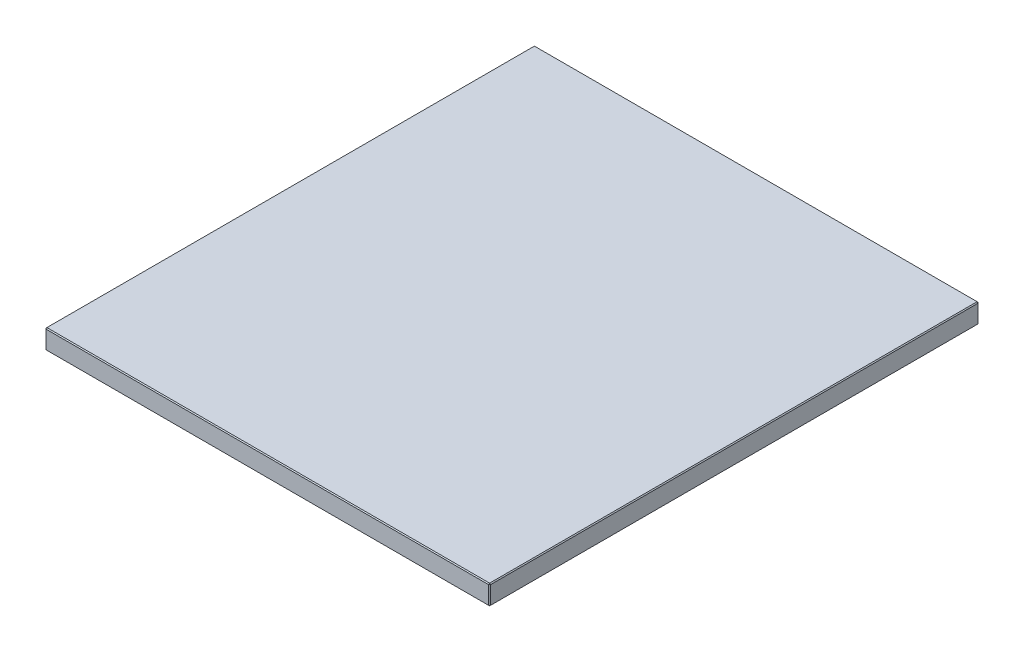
ISO-10303-21;
HEADER;
FILE_DESCRIPTION(('STEP AP214'),'2;1');
FILE_NAME('part.step','',(''),(''),'','','');
FILE_SCHEMA(('AUTOMOTIVE_DESIGN { 1 0 10303 214 1 1 1 1 }'));
ENDSEC;
DATA;
#1=APPLICATION_CONTEXT('core data for automotive mechanical design processes');
#2=APPLICATION_PROTOCOL_DEFINITION('international standard','automotive_design',2000,#1);
#3=PRODUCT_CONTEXT('',#1,'mechanical');
#4=PRODUCT('Part','Part','',(#3));
#5=PRODUCT_RELATED_PRODUCT_CATEGORY('part','',(#4));
#6=PRODUCT_DEFINITION_FORMATION('','',#4);
#7=PRODUCT_DEFINITION_CONTEXT('part definition',#1,'design');
#8=PRODUCT_DEFINITION('design','',#6,#7);
#9=PRODUCT_DEFINITION_SHAPE('','',#8);
#10=(LENGTH_UNIT() NAMED_UNIT(*) SI_UNIT(.MILLI.,.METRE.));
#11=(NAMED_UNIT(*) PLANE_ANGLE_UNIT() SI_UNIT($,.RADIAN.));
#12=(NAMED_UNIT(*) SI_UNIT($,.STERADIAN.) SOLID_ANGLE_UNIT());
#13=UNCERTAINTY_MEASURE_WITH_UNIT(LENGTH_MEASURE(1.E-05),#10,'distance_accuracy_value','');
#14=(GEOMETRIC_REPRESENTATION_CONTEXT(3) GLOBAL_UNCERTAINTY_ASSIGNED_CONTEXT((#13)) GLOBAL_UNIT_ASSIGNED_CONTEXT((#10,
#11,#12)) REPRESENTATION_CONTEXT('',''));
#15=CARTESIAN_POINT('',(0.,0.,0.));
#16=DIRECTION('',(0.,0.,1.));
#17=DIRECTION('',(1.,0.,0.));
#18=AXIS2_PLACEMENT_3D('',#15,#16,#17);
#19=CARTESIAN_POINT('',(-248.,22.,273.));
#20=DIRECTION('',(1.,0.,0.));
#21=DIRECTION('',(0.,0.,-1.));
#22=AXIS2_PLACEMENT_3D('',#19,#20,#21);
#23=PLANE('',#22);
#24=DIRECTION('',(0.,-1.,0.));
#25=VECTOR('',#24,1.);
#26=CARTESIAN_POINT('',(-248.,22.,-272.));
#27=LINE('',#26,#25);
#28=CARTESIAN_POINT('',(-248.,21.,-272.));
#29=VERTEX_POINT('',#28);
#30=CARTESIAN_POINT('',(-248.,1.00000000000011,-272.));
#31=VERTEX_POINT('',#30);
#32=EDGE_CURVE('E114',#29,#31,#27,.T.);
#33=ORIENTED_EDGE('',*,*,#32,.T.);
#34=DIRECTION('',(0.,0.,1.));
#35=VECTOR('',#34,1.);
#36=CARTESIAN_POINT('',(-248.,1.00000000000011,273.));
#37=LINE('',#36,#35);
#38=CARTESIAN_POINT('',(-248.,1.00000000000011,272.));
#39=VERTEX_POINT('',#38);
#40=EDGE_CURVE('E110',#31,#39,#37,.T.);
#41=ORIENTED_EDGE('',*,*,#40,.T.);
#42=DIRECTION('',(0.,1.,0.));
#43=VECTOR('',#42,1.);
#44=CARTESIAN_POINT('',(-248.,22.,272.));
#45=LINE('',#44,#43);
#46=CARTESIAN_POINT('',(-248.,21.,272.));
#47=VERTEX_POINT('',#46);
#48=EDGE_CURVE('E103',#39,#47,#45,.T.);
#49=ORIENTED_EDGE('',*,*,#48,.T.);
#50=DIRECTION('',(0.,0.,-1.));
#51=VECTOR('',#50,1.);
#52=CARTESIAN_POINT('',(-248.,21.,-273.));
#53=LINE('',#52,#51);
#54=EDGE_CURVE('E107',#47,#29,#53,.T.);
#55=ORIENTED_EDGE('',*,*,#54,.T.);
#56=EDGE_LOOP('',(#33,#41,#49,#55));
#57=FACE_BOUND('',#56,.T.);
#58=ADVANCED_FACE('F15',(#57),#23,.F.);
#59=CARTESIAN_POINT('',(248.,22.,273.));
#60=DIRECTION('',(0.,0.,-1.));
#61=DIRECTION('',(-1.,0.,0.));
#62=AXIS2_PLACEMENT_3D('',#59,#60,#61);
#63=PLANE('',#62);
#64=DIRECTION('',(-1.,0.,0.));
#65=VECTOR('',#64,1.);
#66=CARTESIAN_POINT('',(-248.,21.,273.));
#67=LINE('',#66,#65);
#68=CARTESIAN_POINT('',(247.,21.,273.));
#69=VERTEX_POINT('',#68);
#70=CARTESIAN_POINT('',(-247.,21.,273.));
#71=VERTEX_POINT('',#70);
#72=EDGE_CURVE('E164',#69,#71,#67,.T.);
#73=ORIENTED_EDGE('',*,*,#72,.T.);
#74=DIRECTION('',(0.,-1.,0.));
#75=VECTOR('',#74,1.);
#76=CARTESIAN_POINT('',(-247.,22.,273.));
#77=LINE('',#76,#75);
#78=CARTESIAN_POINT('',(-247.,1.00000000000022,273.));
#79=VERTEX_POINT('',#78);
#80=EDGE_CURVE('E122',#71,#79,#77,.T.);
#81=ORIENTED_EDGE('',*,*,#80,.T.);
#82=DIRECTION('',(1.,0.,0.));
#83=VECTOR('',#82,1.);
#84=CARTESIAN_POINT('',(248.,1.00000000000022,273.));
#85=LINE('',#84,#83);
#86=CARTESIAN_POINT('',(247.,1.00000000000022,273.));
#87=VERTEX_POINT('',#86);
#88=EDGE_CURVE('E168',#79,#87,#85,.T.);
#89=ORIENTED_EDGE('',*,*,#88,.T.);
#90=DIRECTION('',(0.,1.,0.));
#91=VECTOR('',#90,1.);
#92=CARTESIAN_POINT('',(247.,22.,273.));
#93=LINE('',#92,#91);
#94=EDGE_CURVE('E166',#87,#69,#93,.T.);
#95=ORIENTED_EDGE('',*,*,#94,.T.);
#96=EDGE_LOOP('',(#73,#81,#89,#95));
#97=FACE_BOUND('',#96,.T.);
#98=ADVANCED_FACE('F275',(#97),#63,.F.);
#99=CARTESIAN_POINT('',(248.,22.,273.));
#100=DIRECTION('',(-1.,0.,0.));
#101=DIRECTION('',(0.,0.,1.));
#102=AXIS2_PLACEMENT_3D('',#99,#100,#101);
#103=PLANE('',#102);
#104=DIRECTION('',(0.,0.,-1.));
#105=VECTOR('',#104,1.);
#106=CARTESIAN_POINT('',(248.,1.00000000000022,273.));
#107=LINE('',#106,#105);
#108=CARTESIAN_POINT('',(248.,1.00000000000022,272.));
#109=VERTEX_POINT('',#108);
#110=CARTESIAN_POINT('',(248.,1.00000000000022,-272.));
#111=VERTEX_POINT('',#110);
#112=EDGE_CURVE('E159',#109,#111,#107,.T.);
#113=ORIENTED_EDGE('',*,*,#112,.T.);
#114=DIRECTION('',(0.,1.,0.));
#115=VECTOR('',#114,1.);
#116=CARTESIAN_POINT('',(248.,22.,-272.));
#117=LINE('',#116,#115);
#118=CARTESIAN_POINT('',(248.,21.,-272.));
#119=VERTEX_POINT('',#118);
#120=EDGE_CURVE('E161',#111,#119,#117,.T.);
#121=ORIENTED_EDGE('',*,*,#120,.T.);
#122=DIRECTION('',(0.,0.,1.));
#123=VECTOR('',#122,1.);
#124=CARTESIAN_POINT('',(248.,21.,273.));
#125=LINE('',#124,#123);
#126=CARTESIAN_POINT('',(248.,21.,272.));
#127=VERTEX_POINT('',#126);
#128=EDGE_CURVE('E155',#119,#127,#125,.T.);
#129=ORIENTED_EDGE('',*,*,#128,.T.);
#130=DIRECTION('',(0.,-1.,0.));
#131=VECTOR('',#130,1.);
#132=CARTESIAN_POINT('',(248.,22.,272.));
#133=LINE('',#132,#131);
#134=EDGE_CURVE('E157',#127,#109,#133,.T.);
#135=ORIENTED_EDGE('',*,*,#134,.T.);
#136=EDGE_LOOP('',(#113,#121,#129,#135));
#137=FACE_BOUND('',#136,.T.);
#138=ADVANCED_FACE('F254',(#137),#103,.F.);
#139=CARTESIAN_POINT('',(248.,22.,-273.));
#140=DIRECTION('',(0.,0.,1.));
#141=DIRECTION('',(1.,0.,0.));
#142=AXIS2_PLACEMENT_3D('',#139,#140,#141);
#143=PLANE('',#142);
#144=DIRECTION('',(0.,-1.,0.));
#145=VECTOR('',#144,1.);
#146=CARTESIAN_POINT('',(247.,22.,-273.));
#147=LINE('',#146,#145);
#148=CARTESIAN_POINT('',(247.,21.,-273.));
#149=VERTEX_POINT('',#148);
#150=CARTESIAN_POINT('',(247.,1.00000000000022,-273.));
#151=VERTEX_POINT('',#150);
#152=EDGE_CURVE('E148',#149,#151,#147,.T.);
#153=ORIENTED_EDGE('',*,*,#152,.T.);
#154=DIRECTION('',(-1.,0.,0.));
#155=VECTOR('',#154,1.);
#156=CARTESIAN_POINT('',(248.,1.00000000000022,-273.));
#157=LINE('',#156,#155);
#158=CARTESIAN_POINT('',(-247.,1.00000000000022,-273.));
#159=VERTEX_POINT('',#158);
#160=EDGE_CURVE('E153',#151,#159,#157,.T.);
#161=ORIENTED_EDGE('',*,*,#160,.T.);
#162=DIRECTION('',(0.,1.,0.));
#163=VECTOR('',#162,1.);
#164=CARTESIAN_POINT('',(-247.,22.,-273.));
#165=LINE('',#164,#163);
#166=CARTESIAN_POINT('',(-247.,21.,-273.));
#167=VERTEX_POINT('',#166);
#168=EDGE_CURVE('E150',#159,#167,#165,.T.);
#169=ORIENTED_EDGE('',*,*,#168,.T.);
#170=DIRECTION('',(1.,0.,0.));
#171=VECTOR('',#170,1.);
#172=CARTESIAN_POINT('',(248.,21.,-273.));
#173=LINE('',#172,#171);
#174=EDGE_CURVE('E146',#167,#149,#173,.T.);
#175=ORIENTED_EDGE('',*,*,#174,.T.);
#176=EDGE_LOOP('',(#153,#161,#169,#175));
#177=FACE_BOUND('',#176,.T.);
#178=ADVANCED_FACE('F284',(#177),#143,.F.);
#179=CARTESIAN_POINT('',(0.,22.,0.));
#180=DIRECTION('',(0.,1.,0.));
#181=DIRECTION('',(0.,0.,1.));
#182=AXIS2_PLACEMENT_3D('',#179,#180,#181);
#183=PLANE('',#182);
#184=DIRECTION('',(0.,0.,-1.));
#185=VECTOR('',#184,1.);
#186=CARTESIAN_POINT('',(247.,22.,-273.));
#187=LINE('',#186,#185);
#188=CARTESIAN_POINT('',(247.,22.,272.));
#189=VERTEX_POINT('',#188);
#190=CARTESIAN_POINT('',(247.,22.,-272.));
#191=VERTEX_POINT('',#190);
#192=EDGE_CURVE('E24',#189,#191,#187,.T.);
#193=ORIENTED_EDGE('',*,*,#192,.T.);
#194=DIRECTION('',(-1.,0.,0.));
#195=VECTOR('',#194,1.);
#196=CARTESIAN_POINT('',(-248.,22.,-272.));
#197=LINE('',#196,#195);
#198=CARTESIAN_POINT('',(-247.,22.,-272.));
#199=VERTEX_POINT('',#198);
#200=EDGE_CURVE('E9',#191,#199,#197,.T.);
#201=ORIENTED_EDGE('',*,*,#200,.T.);
#202=DIRECTION('',(0.,0.,1.));
#203=VECTOR('',#202,1.);
#204=CARTESIAN_POINT('',(-247.,22.,273.));
#205=LINE('',#204,#203);
#206=CARTESIAN_POINT('',(-247.,22.,272.));
#207=VERTEX_POINT('',#206);
#208=EDGE_CURVE('E180',#199,#207,#205,.T.);
#209=ORIENTED_EDGE('',*,*,#208,.T.);
#210=DIRECTION('',(1.,0.,0.));
#211=VECTOR('',#210,1.);
#212=CARTESIAN_POINT('',(248.,22.,272.));
#213=LINE('',#212,#211);
#214=EDGE_CURVE('E35',#207,#189,#213,.T.);
#215=ORIENTED_EDGE('',*,*,#214,.T.);
#216=EDGE_LOOP('',(#193,#201,#209,#215));
#217=FACE_BOUND('',#216,.T.);
#218=ADVANCED_FACE('F350',(#217),#183,.T.);
#219=CARTESIAN_POINT('',(0.,0.,0.));
#220=DIRECTION('',(0.,1.,0.));
#221=DIRECTION('',(0.,0.,1.));
#222=AXIS2_PLACEMENT_3D('',#219,#220,#221);
#223=PLANE('',#222);
#224=DIRECTION('',(0.,0.,1.));
#225=VECTOR('',#224,1.);
#226=CARTESIAN_POINT('',(247.,0.,0.));
#227=LINE('',#226,#225);
#228=CARTESIAN_POINT('',(247.,0.,-272.));
#229=VERTEX_POINT('',#228);
#230=CARTESIAN_POINT('',(247.,0.,272.));
#231=VERTEX_POINT('',#230);
#232=EDGE_CURVE('E171',#229,#231,#227,.T.);
#233=ORIENTED_EDGE('',*,*,#232,.T.);
#234=DIRECTION('',(-1.,0.,0.));
#235=VECTOR('',#234,1.);
#236=CARTESIAN_POINT('',(0.,0.,272.));
#237=LINE('',#236,#235);
#238=CARTESIAN_POINT('',(-247.,0.,272.));
#239=VERTEX_POINT('',#238);
#240=EDGE_CURVE('E177',#231,#239,#237,.T.);
#241=ORIENTED_EDGE('',*,*,#240,.T.);
#242=DIRECTION('',(0.,0.,-1.));
#243=VECTOR('',#242,1.);
#244=CARTESIAN_POINT('',(-247.,0.,0.));
#245=LINE('',#244,#243);
#246=CARTESIAN_POINT('',(-247.,0.,-272.));
#247=VERTEX_POINT('',#246);
#248=EDGE_CURVE('E175',#239,#247,#245,.T.);
#249=ORIENTED_EDGE('',*,*,#248,.T.);
#250=DIRECTION('',(1.,0.,0.));
#251=VECTOR('',#250,1.);
#252=CARTESIAN_POINT('',(0.,0.,-272.));
#253=LINE('',#252,#251);
#254=EDGE_CURVE('E173',#247,#229,#253,.T.);
#255=ORIENTED_EDGE('',*,*,#254,.T.);
#256=EDGE_LOOP('',(#233,#241,#249,#255));
#257=FACE_BOUND('',#256,.T.);
#258=ADVANCED_FACE('F246',(#257),#223,.F.);
#259=CARTESIAN_POINT('',(248.,22.,272.));
#260=DIRECTION('',(-0.707106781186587,0.,-0.707106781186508));
#261=DIRECTION('',(0.,-1.,0.));
#262=AXIS2_PLACEMENT_3D('',#259,#260,#261);
#263=PLANE('',#262);
#264=DIRECTION('',(-0.707106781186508,0.,0.707106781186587));
#265=VECTOR('',#264,1.);
#266=CARTESIAN_POINT('',(247.,21.,273.));
#267=LINE('',#266,#265);
#268=EDGE_CURVE('E19',#69,#127,#267,.F.);
#269=ORIENTED_EDGE('',*,*,#268,.F.);
#270=ORIENTED_EDGE('',*,*,#94,.F.);
#271=DIRECTION('',(0.707106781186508,0.,-0.707106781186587));
#272=VECTOR('',#271,1.);
#273=CARTESIAN_POINT('',(247.,1.00000000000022,273.));
#274=LINE('',#273,#272);
#275=EDGE_CURVE('E142',#109,#87,#274,.F.);
#276=ORIENTED_EDGE('',*,*,#275,.F.);
#277=ORIENTED_EDGE('',*,*,#134,.F.);
#278=EDGE_LOOP('',(#269,#270,#276,#277));
#279=FACE_BOUND('',#278,.T.);
#280=ADVANCED_FACE('F17',(#279),#263,.F.);
#281=CARTESIAN_POINT('',(247.,21.,273.));
#282=DIRECTION('',(0.577350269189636,0.577350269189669,0.577350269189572));
#283=DIRECTION('',(-0.707106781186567,0.707106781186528,0.));
#284=AXIS2_PLACEMENT_3D('',#281,#282,#283);
#285=PLANE('',#284);
#286=DIRECTION('',(0.,-0.707106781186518,0.707106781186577));
#287=VECTOR('',#286,1.);
#288=CARTESIAN_POINT('',(247.,21.,273.));
#289=LINE('',#288,#287);
#290=EDGE_CURVE('E226',#69,#189,#289,.F.);
#291=ORIENTED_EDGE('',*,*,#290,.F.);
#292=ORIENTED_EDGE('',*,*,#268,.T.);
#293=DIRECTION('',(-0.707106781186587,0.707106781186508,0.));
#294=VECTOR('',#293,1.);
#295=CARTESIAN_POINT('',(247.5,21.5,272.));
#296=LINE('',#295,#294);
#297=EDGE_CURVE('E228',#189,#127,#296,.F.);
#298=ORIENTED_EDGE('',*,*,#297,.F.);
#299=EDGE_LOOP('',(#291,#292,#298));
#300=FACE_BOUND('',#299,.T.);
#301=ADVANCED_FACE('F270',(#300),#285,.T.);
#302=CARTESIAN_POINT('',(247.,1.00000000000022,273.));
#303=DIRECTION('',(0.57735026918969,-0.577350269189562,0.577350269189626));
#304=DIRECTION('',(0.707106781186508,0.,-0.707106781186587));
#305=AXIS2_PLACEMENT_3D('',#302,#303,#304);
#306=PLANE('',#305);
#307=DIRECTION('',(-0.707106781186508,-0.707106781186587,0.));
#308=VECTOR('',#307,1.);
#309=CARTESIAN_POINT('',(247.5,0.500000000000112,272.));
#310=LINE('',#309,#308);
#311=EDGE_CURVE('E220',#109,#231,#310,.T.);
#312=ORIENTED_EDGE('',*,*,#311,.F.);
#313=ORIENTED_EDGE('',*,*,#275,.T.);
#314=DIRECTION('',(0.,0.707106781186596,0.707106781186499));
#315=VECTOR('',#314,1.);
#316=CARTESIAN_POINT('',(247.,1.00000000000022,273.));
#317=LINE('',#316,#315);
#318=EDGE_CURVE('E223',#231,#87,#317,.T.);
#319=ORIENTED_EDGE('',*,*,#318,.F.);
#320=EDGE_LOOP('',(#312,#313,#319));
#321=FACE_BOUND('',#320,.T.);
#322=ADVANCED_FACE('F235',(#321),#306,.T.);
#323=CARTESIAN_POINT('',(247.,22.,0.));
#324=DIRECTION('',(0.707106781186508,0.707106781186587,0.));
#325=DIRECTION('',(0.,0.,1.));
#326=AXIS2_PLACEMENT_3D('',#323,#324,#325);
#327=PLANE('',#326);
#328=ORIENTED_EDGE('',*,*,#297,.T.);
#329=ORIENTED_EDGE('',*,*,#128,.F.);
#330=DIRECTION('',(0.707106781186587,-0.707106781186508,0.));
#331=VECTOR('',#330,1.);
#332=CARTESIAN_POINT('',(248.,21.,-272.));
#333=LINE('',#332,#331);
#334=EDGE_CURVE('E215',#191,#119,#333,.T.);
#335=ORIENTED_EDGE('',*,*,#334,.F.);
#336=ORIENTED_EDGE('',*,*,#192,.F.);
#337=EDGE_LOOP('',(#328,#329,#335,#336));
#338=FACE_BOUND('',#337,.T.);
#339=ADVANCED_FACE('F265',(#338),#327,.T.);
#340=CARTESIAN_POINT('',(0.,22.,272.));
#341=DIRECTION('',(0.,0.707106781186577,0.707106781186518));
#342=DIRECTION('',(-1.,0.,0.));
#343=AXIS2_PLACEMENT_3D('',#340,#341,#342);
#344=PLANE('',#343);
#345=ORIENTED_EDGE('',*,*,#290,.T.);
#346=ORIENTED_EDGE('',*,*,#214,.F.);
#347=DIRECTION('',(0.,0.707106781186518,-0.707106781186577));
#348=VECTOR('',#347,1.);
#349=CARTESIAN_POINT('',(-247.,21.5,272.5));
#350=LINE('',#349,#348);
#351=EDGE_CURVE('E126',#71,#207,#350,.T.);
#352=ORIENTED_EDGE('',*,*,#351,.F.);
#353=ORIENTED_EDGE('',*,*,#72,.F.);
#354=EDGE_LOOP('',(#345,#346,#352,#353));
#355=FACE_BOUND('',#354,.T.);
#356=ADVANCED_FACE('F273',(#355),#344,.T.);
#357=CARTESIAN_POINT('',(-247.,22.,273.));
#358=DIRECTION('',(0.707106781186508,0.,-0.707106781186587));
#359=DIRECTION('',(0.,-1.,0.));
#360=AXIS2_PLACEMENT_3D('',#357,#358,#359);
#361=PLANE('',#360);
#362=DIRECTION('',(0.707106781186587,0.,0.707106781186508));
#363=VECTOR('',#362,1.);
#364=CARTESIAN_POINT('',(-247.,1.00000000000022,273.));
#365=LINE('',#364,#363);
#366=EDGE_CURVE('E127',#79,#39,#365,.F.);
#367=ORIENTED_EDGE('',*,*,#366,.F.);
#368=ORIENTED_EDGE('',*,*,#80,.F.);
#369=DIRECTION('',(-0.707106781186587,0.,-0.707106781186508));
#370=VECTOR('',#369,1.);
#371=CARTESIAN_POINT('',(-248.,21.,272.));
#372=LINE('',#371,#370);
#373=EDGE_CURVE('E118',#47,#71,#372,.F.);
#374=ORIENTED_EDGE('',*,*,#373,.F.);
#375=ORIENTED_EDGE('',*,*,#48,.F.);
#376=EDGE_LOOP('',(#367,#368,#374,#375));
#377=FACE_BOUND('',#376,.T.);
#378=ADVANCED_FACE('F120',(#377),#361,.F.);
#379=CARTESIAN_POINT('',(248.,1.00000000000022,273.));
#380=DIRECTION('',(0.,0.707106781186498,-0.707106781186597));
#381=DIRECTION('',(1.,0.,0.));
#382=AXIS2_PLACEMENT_3D('',#379,#380,#381);
#383=PLANE('',#382);
#384=ORIENTED_EDGE('',*,*,#318,.T.);
#385=ORIENTED_EDGE('',*,*,#88,.F.);
#386=DIRECTION('',(0.,-0.707106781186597,-0.707106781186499));
#387=VECTOR('',#386,1.);
#388=CARTESIAN_POINT('',(-247.,1.00000000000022,273.));
#389=LINE('',#388,#387);
#390=EDGE_CURVE('E211',#239,#79,#389,.F.);
#391=ORIENTED_EDGE('',*,*,#390,.F.);
#392=ORIENTED_EDGE('',*,*,#240,.F.);
#393=EDGE_LOOP('',(#384,#385,#391,#392));
#394=FACE_BOUND('',#393,.T.);
#395=ADVANCED_FACE('F243',(#394),#383,.F.);
#396=CARTESIAN_POINT('',(248.,1.00000000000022,273.));
#397=DIRECTION('',(-0.707106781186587,0.707106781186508,0.));
#398=DIRECTION('',(0.,0.,-1.));
#399=AXIS2_PLACEMENT_3D('',#396,#397,#398);
#400=PLANE('',#399);
#401=ORIENTED_EDGE('',*,*,#311,.T.);
#402=ORIENTED_EDGE('',*,*,#232,.F.);
#403=DIRECTION('',(0.707106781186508,0.707106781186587,0.));
#404=VECTOR('',#403,1.);
#405=CARTESIAN_POINT('',(247.5,0.500000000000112,-272.));
#406=LINE('',#405,#404);
#407=EDGE_CURVE('E208',#111,#229,#406,.F.);
#408=ORIENTED_EDGE('',*,*,#407,.F.);
#409=ORIENTED_EDGE('',*,*,#112,.F.);
#410=EDGE_LOOP('',(#401,#402,#408,#409));
#411=FACE_BOUND('',#410,.T.);
#412=ADVANCED_FACE('F251',(#411),#400,.F.);
#413=CARTESIAN_POINT('',(247.,22.,-273.));
#414=DIRECTION('',(-0.707106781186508,0.,0.707106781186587));
#415=DIRECTION('',(0.,-1.,0.));
#416=AXIS2_PLACEMENT_3D('',#413,#414,#415);
#417=PLANE('',#416);
#418=DIRECTION('',(0.707106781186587,0.,0.707106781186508));
#419=VECTOR('',#418,1.);
#420=CARTESIAN_POINT('',(248.,21.,-272.));
#421=LINE('',#420,#419);
#422=EDGE_CURVE('E217',#119,#149,#421,.F.);
#423=ORIENTED_EDGE('',*,*,#422,.F.);
#424=ORIENTED_EDGE('',*,*,#120,.F.);
#425=DIRECTION('',(-0.707106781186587,0.,-0.707106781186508));
#426=VECTOR('',#425,1.);
#427=CARTESIAN_POINT('',(247.,1.00000000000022,-273.));
#428=LINE('',#427,#426);
#429=EDGE_CURVE('E205',#151,#111,#428,.F.);
#430=ORIENTED_EDGE('',*,*,#429,.F.);
#431=ORIENTED_EDGE('',*,*,#152,.F.);
#432=EDGE_LOOP('',(#423,#424,#430,#431));
#433=FACE_BOUND('',#432,.T.);
#434=ADVANCED_FACE('F258',(#433),#417,.F.);
#435=CARTESIAN_POINT('',(248.,21.,-272.));
#436=DIRECTION('',(0.577350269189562,0.57735026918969,-0.577350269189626));
#437=DIRECTION('',(0.,0.707106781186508,0.707106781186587));
#438=AXIS2_PLACEMENT_3D('',#435,#436,#437);
#439=PLANE('',#438);
#440=ORIENTED_EDGE('',*,*,#334,.T.);
#441=ORIENTED_EDGE('',*,*,#422,.T.);
#442=DIRECTION('',(0.,0.707106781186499,0.707106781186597));
#443=VECTOR('',#442,1.);
#444=CARTESIAN_POINT('',(247.,21.5,-272.5));
#445=LINE('',#444,#443);
#446=EDGE_CURVE('E134',#191,#149,#445,.F.);
#447=ORIENTED_EDGE('',*,*,#446,.F.);
#448=EDGE_LOOP('',(#440,#441,#447));
#449=FACE_BOUND('',#448,.T.);
#450=ADVANCED_FACE('F325',(#449),#439,.T.);
#451=CARTESIAN_POINT('',(-248.,21.,272.));
#452=DIRECTION('',(-0.577350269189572,0.577350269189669,0.577350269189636));
#453=DIRECTION('',(0.,-0.707106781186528,0.707106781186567));
#454=AXIS2_PLACEMENT_3D('',#451,#452,#453);
#455=PLANE('',#454);
#456=ORIENTED_EDGE('',*,*,#373,.T.);
#457=ORIENTED_EDGE('',*,*,#351,.T.);
#458=DIRECTION('',(-0.707106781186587,-0.707106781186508,0.));
#459=VECTOR('',#458,1.);
#460=CARTESIAN_POINT('',(-248.,21.,272.));
#461=LINE('',#460,#459);
#462=EDGE_CURVE('E130',#47,#207,#461,.F.);
#463=ORIENTED_EDGE('',*,*,#462,.F.);
#464=EDGE_LOOP('',(#456,#457,#463));
#465=FACE_BOUND('',#464,.T.);
#466=ADVANCED_FACE('F131',(#465),#455,.T.);
#467=CARTESIAN_POINT('',(-247.,1.00000000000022,273.));
#468=DIRECTION('',(-0.577350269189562,-0.577350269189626,0.57735026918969));
#469=DIRECTION('',(0.,-0.707106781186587,-0.707106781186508));
#470=AXIS2_PLACEMENT_3D('',#467,#468,#469);
#471=PLANE('',#470);
#472=ORIENTED_EDGE('',*,*,#390,.T.);
#473=ORIENTED_EDGE('',*,*,#366,.T.);
#474=DIRECTION('',(-0.707106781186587,0.707106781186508,0.));
#475=VECTOR('',#474,1.);
#476=CARTESIAN_POINT('',(-247.5,0.500000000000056,272.));
#477=LINE('',#476,#475);
#478=EDGE_CURVE('E135',#239,#39,#477,.T.);
#479=ORIENTED_EDGE('',*,*,#478,.F.);
#480=EDGE_LOOP('',(#472,#473,#479));
#481=FACE_BOUND('',#480,.T.);
#482=ADVANCED_FACE('F318',(#481),#471,.T.);
#483=CARTESIAN_POINT('',(247.,1.00000000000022,-273.));
#484=DIRECTION('',(0.577350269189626,-0.577350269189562,-0.57735026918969));
#485=DIRECTION('',(-0.707106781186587,0.,-0.707106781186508));
#486=AXIS2_PLACEMENT_3D('',#483,#484,#485);
#487=PLANE('',#486);
#488=ORIENTED_EDGE('',*,*,#429,.T.);
#489=ORIENTED_EDGE('',*,*,#407,.T.);
#490=DIRECTION('',(0.,-0.707106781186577,0.707106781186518));
#491=VECTOR('',#490,1.);
#492=CARTESIAN_POINT('',(247.,1.00000000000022,-273.));
#493=LINE('',#492,#491);
#494=EDGE_CURVE('E198',#151,#229,#493,.T.);
#495=ORIENTED_EDGE('',*,*,#494,.F.);
#496=EDGE_LOOP('',(#488,#489,#495));
#497=FACE_BOUND('',#496,.T.);
#498=ADVANCED_FACE('F314',(#497),#487,.T.);
#499=CARTESIAN_POINT('',(0.,22.,-272.));
#500=DIRECTION('',(0.,0.707106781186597,-0.707106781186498));
#501=DIRECTION('',(1.,0.,0.));
#502=AXIS2_PLACEMENT_3D('',#499,#500,#501);
#503=PLANE('',#502);
#504=ORIENTED_EDGE('',*,*,#446,.T.);
#505=ORIENTED_EDGE('',*,*,#174,.F.);
#506=DIRECTION('',(0.,-0.707106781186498,-0.707106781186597));
#507=VECTOR('',#506,1.);
#508=CARTESIAN_POINT('',(-247.,21.,-273.));
#509=LINE('',#508,#507);
#510=EDGE_CURVE('E195',#199,#167,#509,.T.);
#511=ORIENTED_EDGE('',*,*,#510,.F.);
#512=ORIENTED_EDGE('',*,*,#200,.F.);
#513=EDGE_LOOP('',(#504,#505,#511,#512));
#514=FACE_BOUND('',#513,.T.);
#515=ADVANCED_FACE('F311',(#514),#503,.T.);
#516=CARTESIAN_POINT('',(-247.,22.,0.));
#517=DIRECTION('',(-0.707106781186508,0.707106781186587,0.));
#518=DIRECTION('',(0.,0.,-1.));
#519=AXIS2_PLACEMENT_3D('',#516,#517,#518);
#520=PLANE('',#519);
#521=ORIENTED_EDGE('',*,*,#462,.T.);
#522=ORIENTED_EDGE('',*,*,#208,.F.);
#523=DIRECTION('',(0.707106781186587,0.707106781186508,0.));
#524=VECTOR('',#523,1.);
#525=CARTESIAN_POINT('',(-247.5,21.5,-272.));
#526=LINE('',#525,#524);
#527=EDGE_CURVE('E138',#29,#199,#526,.T.);
#528=ORIENTED_EDGE('',*,*,#527,.F.);
#529=ORIENTED_EDGE('',*,*,#54,.F.);
#530=EDGE_LOOP('',(#521,#522,#528,#529));
#531=FACE_BOUND('',#530,.T.);
#532=ADVANCED_FACE('F137',(#531),#520,.T.);
#533=CARTESIAN_POINT('',(-248.,1.00000000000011,273.));
#534=DIRECTION('',(0.707106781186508,0.707106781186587,0.));
#535=DIRECTION('',(0.,0.,1.));
#536=AXIS2_PLACEMENT_3D('',#533,#534,#535);
#537=PLANE('',#536);
#538=ORIENTED_EDGE('',*,*,#478,.T.);
#539=ORIENTED_EDGE('',*,*,#40,.F.);
#540=DIRECTION('',(0.707106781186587,-0.707106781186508,0.));
#541=VECTOR('',#540,1.);
#542=CARTESIAN_POINT('',(-248.,1.00000000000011,-272.));
#543=LINE('',#542,#541);
#544=EDGE_CURVE('E191',#247,#31,#543,.F.);
#545=ORIENTED_EDGE('',*,*,#544,.F.);
#546=ORIENTED_EDGE('',*,*,#248,.F.);
#547=EDGE_LOOP('',(#538,#539,#545,#546));
#548=FACE_BOUND('',#547,.T.);
#549=ADVANCED_FACE('F304',(#548),#537,.F.);
#550=CARTESIAN_POINT('',(248.,1.00000000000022,-273.));
#551=DIRECTION('',(0.,0.707106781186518,0.707106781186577));
#552=DIRECTION('',(-1.,0.,0.));
#553=AXIS2_PLACEMENT_3D('',#550,#551,#552);
#554=PLANE('',#553);
#555=ORIENTED_EDGE('',*,*,#494,.T.);
#556=ORIENTED_EDGE('',*,*,#254,.F.);
#557=DIRECTION('',(0.,0.707106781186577,-0.707106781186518));
#558=VECTOR('',#557,1.);
#559=CARTESIAN_POINT('',(-247.,0.500000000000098,-272.5));
#560=LINE('',#559,#558);
#561=EDGE_CURVE('E188',#159,#247,#560,.F.);
#562=ORIENTED_EDGE('',*,*,#561,.F.);
#563=ORIENTED_EDGE('',*,*,#160,.F.);
#564=EDGE_LOOP('',(#555,#556,#562,#563));
#565=FACE_BOUND('',#564,.T.);
#566=ADVANCED_FACE('F300',(#565),#554,.F.);
#567=CARTESIAN_POINT('',(-247.,21.,-273.));
#568=DIRECTION('',(-0.577350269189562,0.57735026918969,-0.577350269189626));
#569=DIRECTION('',(0.,0.707106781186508,0.707106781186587));
#570=AXIS2_PLACEMENT_3D('',#567,#568,#569);
#571=PLANE('',#570);
#572=ORIENTED_EDGE('',*,*,#527,.T.);
#573=ORIENTED_EDGE('',*,*,#510,.T.);
#574=DIRECTION('',(0.707106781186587,0.,-0.707106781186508));
#575=VECTOR('',#574,1.);
#576=CARTESIAN_POINT('',(-247.,21.,-273.));
#577=LINE('',#576,#575);
#578=EDGE_CURVE('E186',#29,#167,#577,.T.);
#579=ORIENTED_EDGE('',*,*,#578,.F.);
#580=EDGE_LOOP('',(#572,#573,#579));
#581=FACE_BOUND('',#580,.T.);
#582=ADVANCED_FACE('F296',(#581),#571,.T.);
#583=CARTESIAN_POINT('',(-248.,1.00000000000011,-272.));
#584=DIRECTION('',(-0.577350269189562,-0.577350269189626,-0.57735026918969));
#585=DIRECTION('',(0.,0.707106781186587,-0.707106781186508));
#586=AXIS2_PLACEMENT_3D('',#583,#584,#585);
#587=PLANE('',#586);
#588=ORIENTED_EDGE('',*,*,#561,.T.);
#589=ORIENTED_EDGE('',*,*,#544,.T.);
#590=DIRECTION('',(-0.707106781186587,0.,0.707106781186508));
#591=VECTOR('',#590,1.);
#592=CARTESIAN_POINT('',(-248.,1.00000000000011,-272.));
#593=LINE('',#592,#591);
#594=EDGE_CURVE('E184',#159,#31,#593,.T.);
#595=ORIENTED_EDGE('',*,*,#594,.F.);
#596=EDGE_LOOP('',(#588,#589,#595));
#597=FACE_BOUND('',#596,.T.);
#598=ADVANCED_FACE('F292',(#597),#587,.T.);
#599=CARTESIAN_POINT('',(-248.,22.,-272.));
#600=DIRECTION('',(0.707106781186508,0.,0.707106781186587));
#601=DIRECTION('',(0.,-1.,0.));
#602=AXIS2_PLACEMENT_3D('',#599,#600,#601);
#603=PLANE('',#602);
#604=ORIENTED_EDGE('',*,*,#578,.T.);
#605=ORIENTED_EDGE('',*,*,#168,.F.);
#606=ORIENTED_EDGE('',*,*,#594,.T.);
#607=ORIENTED_EDGE('',*,*,#32,.F.);
#608=EDGE_LOOP('',(#604,#605,#606,#607));
#609=FACE_BOUND('',#608,.T.);
#610=ADVANCED_FACE('F289',(#609),#603,.F.);
#611=CLOSED_SHELL('',(#58,#98,#138,#178,#218,#258,#280,#301,#322,#339,#356,#378,#395,#412,#434,
#450,#466,#482,#498,#515,#532,#549,#566,#582,#598,#610));
#612=MANIFOLD_SOLID_BREP('B1',#611);
#613=ADVANCED_BREP_SHAPE_REPRESENTATION('',(#18,#612),#14);
#614=SHAPE_DEFINITION_REPRESENTATION(#9,#613);
ENDSEC;
END-ISO-10303-21;
